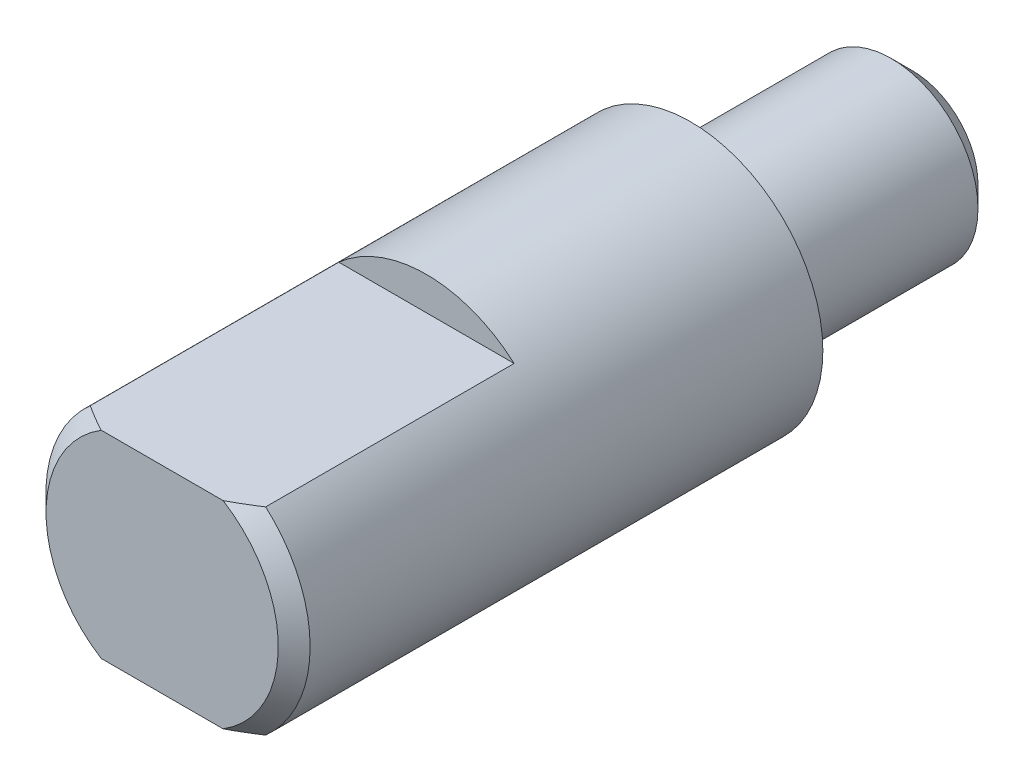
from build123d import *

# Parameters (mm, degrees)
SKETCH2_W          = 6.35
SKETCH2_H          = 0.8
CUT_EXTRUDE1_DEPTH = 5


with BuildPart() as part:
    # Sketch1 → Revolve1 (revolve)
    with BuildSketch(Plane(origin=(0, 0, 0), x_dir=(0, 0, -1), z_dir=(1, 0, 0)), mode=Mode.PRIVATE) as revolve1_sk:
        Polygon((13.966, 1.5728), (13.456, 2.0828), (8.636, 2.0828), (8.636, 3.175), (-3.684, 3.175), (-4.064, 2.79), (-4.064, 0), (13.966, 0), align=None)
    revolve(revolve1_sk.sketch.rotate(Axis((0, 0, 4.064), (0, 0, -1)), 90), axis=Axis((0, 0, 4.064), (0, 0, -1)))

    # Sketch2 → Cut-Extrude1 (cut, symmetric)
    with BuildSketch(Plane(origin=(0, 0, 0), x_dir=(0, 0, -1), z_dir=(1, 0, 0))):
        with Locations((-0.889, 2.775)):
            Rectangle(SKETCH2_W, SKETCH2_H)
        with Locations((-0.889, -2.775)):
            Rectangle(SKETCH2_W, SKETCH2_H)
    extrude(amount=CUT_EXTRUDE1_DEPTH, both=True, mode=Mode.SUBTRACT)


solid = part.part
